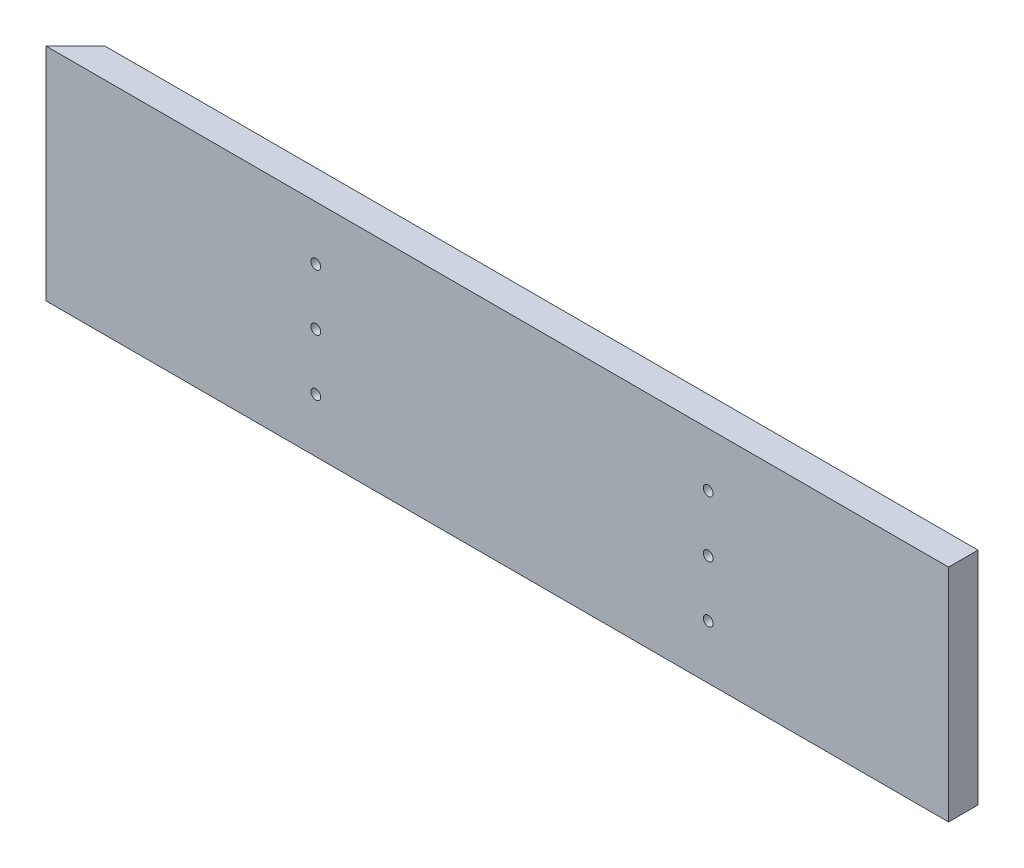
ISO-10303-21;
HEADER;
FILE_DESCRIPTION(('STEP AP214'),'2;1');
FILE_NAME('part.step','',(''),(''),'','','');
FILE_SCHEMA(('AUTOMOTIVE_DESIGN { 1 0 10303 214 1 1 1 1 }'));
ENDSEC;
DATA;
#1=APPLICATION_CONTEXT('core data for automotive mechanical design processes');
#2=APPLICATION_PROTOCOL_DEFINITION('international standard','automotive_design',2000,#1);
#3=PRODUCT_CONTEXT('',#1,'mechanical');
#4=PRODUCT('Part','Part','',(#3));
#5=PRODUCT_RELATED_PRODUCT_CATEGORY('part','',(#4));
#6=PRODUCT_DEFINITION_FORMATION('','',#4);
#7=PRODUCT_DEFINITION_CONTEXT('part definition',#1,'design');
#8=PRODUCT_DEFINITION('design','',#6,#7);
#9=PRODUCT_DEFINITION_SHAPE('','',#8);
#10=(LENGTH_UNIT() NAMED_UNIT(*) SI_UNIT(.MILLI.,.METRE.));
#11=(NAMED_UNIT(*) PLANE_ANGLE_UNIT() SI_UNIT($,.RADIAN.));
#12=(NAMED_UNIT(*) SI_UNIT($,.STERADIAN.) SOLID_ANGLE_UNIT());
#13=UNCERTAINTY_MEASURE_WITH_UNIT(LENGTH_MEASURE(1.E-05),#10,'distance_accuracy_value','');
#14=(GEOMETRIC_REPRESENTATION_CONTEXT(3) GLOBAL_UNCERTAINTY_ASSIGNED_CONTEXT((#13)) GLOBAL_UNIT_ASSIGNED_CONTEXT((#10,
#11,#12)) REPRESENTATION_CONTEXT('',''));
#15=CARTESIAN_POINT('',(0.,0.,0.));
#16=DIRECTION('',(0.,0.,1.));
#17=DIRECTION('',(1.,0.,0.));
#18=AXIS2_PLACEMENT_3D('',#15,#16,#17);
#19=CARTESIAN_POINT('',(1168.4,0.,0.));
#20=DIRECTION('',(0.,0.,-1.));
#21=DIRECTION('',(-1.,0.,0.));
#22=AXIS2_PLACEMENT_3D('',#19,#20,#21);
#23=PLANE('',#22);
#24=CARTESIAN_POINT('',(857.25,215.9,0.));
#25=DIRECTION('',(0.,0.,1.));
#26=DIRECTION('',(1.,0.,0.));
#27=AXIS2_PLACEMENT_3D('',#24,#25,#26);
#28=CIRCLE('',#27,6.34999999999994);
#29=CARTESIAN_POINT('',(863.6,215.9,0.));
#30=VERTEX_POINT('',#29);
#31=EDGE_CURVE('E132',#30,#30,#28,.T.);
#32=ORIENTED_EDGE('',*,*,#31,.F.);
#33=EDGE_LOOP('',(#32));
#34=FACE_BOUND('',#33,.T.);
#35=CARTESIAN_POINT('',(857.25,69.8500000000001,0.));
#36=DIRECTION('',(0.,0.,1.));
#37=DIRECTION('',(1.,0.,0.));
#38=AXIS2_PLACEMENT_3D('',#35,#36,#37);
#39=CIRCLE('',#38,6.34999999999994);
#40=CARTESIAN_POINT('',(863.6,69.8500000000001,0.));
#41=VERTEX_POINT('',#40);
#42=EDGE_CURVE('E121',#41,#41,#39,.T.);
#43=ORIENTED_EDGE('',*,*,#42,.F.);
#44=EDGE_LOOP('',(#43));
#45=FACE_BOUND('',#44,.T.);
#46=CARTESIAN_POINT('',(349.25,69.85,0.));
#47=DIRECTION('',(0.,0.,1.));
#48=DIRECTION('',(1.,0.,0.));
#49=AXIS2_PLACEMENT_3D('',#46,#47,#48);
#50=CIRCLE('',#49,6.34999999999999);
#51=CARTESIAN_POINT('',(355.6,69.85,0.));
#52=VERTEX_POINT('',#51);
#53=EDGE_CURVE('E120',#52,#52,#50,.T.);
#54=ORIENTED_EDGE('',*,*,#53,.F.);
#55=EDGE_LOOP('',(#54));
#56=FACE_BOUND('',#55,.T.);
#57=CARTESIAN_POINT('',(857.25,142.875,0.));
#58=DIRECTION('',(0.,0.,1.));
#59=DIRECTION('',(1.,0.,0.));
#60=AXIS2_PLACEMENT_3D('',#57,#58,#59);
#61=CIRCLE('',#60,6.34999999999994);
#62=CARTESIAN_POINT('',(863.6,142.875,0.));
#63=VERTEX_POINT('',#62);
#64=EDGE_CURVE('E115',#63,#63,#61,.T.);
#65=ORIENTED_EDGE('',*,*,#64,.F.);
#66=EDGE_LOOP('',(#65));
#67=FACE_BOUND('',#66,.T.);
#68=CARTESIAN_POINT('',(349.25,215.9,0.));
#69=DIRECTION('',(0.,0.,1.));
#70=DIRECTION('',(1.,0.,0.));
#71=AXIS2_PLACEMENT_3D('',#68,#69,#70);
#72=CIRCLE('',#71,6.34999999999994);
#73=CARTESIAN_POINT('',(355.6,215.9,0.));
#74=VERTEX_POINT('',#73);
#75=EDGE_CURVE('E133',#74,#74,#72,.T.);
#76=ORIENTED_EDGE('',*,*,#75,.F.);
#77=EDGE_LOOP('',(#76));
#78=FACE_BOUND('',#77,.T.);
#79=CARTESIAN_POINT('',(349.25,142.875,0.));
#80=DIRECTION('',(0.,0.,1.));
#81=DIRECTION('',(1.,0.,0.));
#82=AXIS2_PLACEMENT_3D('',#79,#80,#81);
#83=CIRCLE('',#82,6.34999999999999);
#84=CARTESIAN_POINT('',(355.6,142.875,0.));
#85=VERTEX_POINT('',#84);
#86=EDGE_CURVE('E99',#85,#85,#83,.T.);
#87=ORIENTED_EDGE('',*,*,#86,.F.);
#88=EDGE_LOOP('',(#87));
#89=FACE_BOUND('',#88,.T.);
#90=DIRECTION('',(0.,-1.,0.));
#91=VECTOR('',#90,1.);
#92=CARTESIAN_POINT('',(0.,0.,0.));
#93=LINE('',#92,#91);
#94=CARTESIAN_POINT('',(0.,285.75,0.));
#95=VERTEX_POINT('',#94);
#96=CARTESIAN_POINT('',(0.,0.,0.));
#97=VERTEX_POINT('',#96);
#98=EDGE_CURVE('E80',#95,#97,#93,.T.);
#99=ORIENTED_EDGE('',*,*,#98,.T.);
#100=DIRECTION('',(-1.,0.,0.));
#101=VECTOR('',#100,1.);
#102=CARTESIAN_POINT('',(1168.4,0.,0.));
#103=LINE('',#102,#101);
#104=CARTESIAN_POINT('',(1168.4,0.,0.));
#105=VERTEX_POINT('',#104);
#106=EDGE_CURVE('E11',#105,#97,#103,.T.);
#107=ORIENTED_EDGE('',*,*,#106,.F.);
#108=DIRECTION('',(0.,-1.,0.));
#109=VECTOR('',#108,1.);
#110=CARTESIAN_POINT('',(1168.4,0.,0.));
#111=LINE('',#110,#109);
#112=CARTESIAN_POINT('',(1168.4,285.75,0.));
#113=VERTEX_POINT('',#112);
#114=EDGE_CURVE('E94',#113,#105,#111,.T.);
#115=ORIENTED_EDGE('',*,*,#114,.F.);
#116=DIRECTION('',(-1.,0.,0.));
#117=VECTOR('',#116,1.);
#118=CARTESIAN_POINT('',(1168.4,285.75,0.));
#119=LINE('',#118,#117);
#120=EDGE_CURVE('E93',#113,#95,#119,.T.);
#121=ORIENTED_EDGE('',*,*,#120,.T.);
#122=EDGE_LOOP('',(#99,#107,#115,#121));
#123=FACE_BOUND('',#122,.T.);
#124=ADVANCED_FACE('F39',(#34,#45,#56,#67,#78,#89,#123),#23,.F.);
#125=CARTESIAN_POINT('',(1168.4,0.,0.));
#126=DIRECTION('',(0.,1.,0.));
#127=DIRECTION('',(0.,0.,1.));
#128=AXIS2_PLACEMENT_3D('',#125,#126,#127);
#129=PLANE('',#128);
#130=ORIENTED_EDGE('',*,*,#106,.T.);
#131=DIRECTION('',(0.707106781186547,0.,-0.707106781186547));
#132=VECTOR('',#131,1.);
#133=CARTESIAN_POINT('',(0.,0.,0.));
#134=LINE('',#133,#132);
#135=CARTESIAN_POINT('',(38.1,0.,-38.1));
#136=VERTEX_POINT('',#135);
#137=EDGE_CURVE('E77',#97,#136,#134,.T.);
#138=ORIENTED_EDGE('',*,*,#137,.T.);
#139=DIRECTION('',(-1.,0.,0.));
#140=VECTOR('',#139,1.);
#141=CARTESIAN_POINT('',(1168.4,0.,-38.1));
#142=LINE('',#141,#140);
#143=CARTESIAN_POINT('',(1168.4,0.,-38.1));
#144=VERTEX_POINT('',#143);
#145=EDGE_CURVE('E47',#144,#136,#142,.T.);
#146=ORIENTED_EDGE('',*,*,#145,.F.);
#147=DIRECTION('',(0.,0.,-1.));
#148=VECTOR('',#147,1.);
#149=CARTESIAN_POINT('',(1168.4,0.,0.));
#150=LINE('',#149,#148);
#151=EDGE_CURVE('E89',#105,#144,#150,.T.);
#152=ORIENTED_EDGE('',*,*,#151,.F.);
#153=EDGE_LOOP('',(#130,#138,#146,#152));
#154=FACE_BOUND('',#153,.T.);
#155=ADVANCED_FACE('F88',(#154),#129,.F.);
#156=CARTESIAN_POINT('',(1168.4,0.,-38.1));
#157=DIRECTION('',(0.,0.,1.));
#158=DIRECTION('',(1.,0.,0.));
#159=AXIS2_PLACEMENT_3D('',#156,#157,#158);
#160=PLANE('',#159);
#161=CARTESIAN_POINT('',(857.25,215.9,-38.1));
#162=DIRECTION('',(0.,0.,1.));
#163=DIRECTION('',(1.,0.,0.));
#164=AXIS2_PLACEMENT_3D('',#161,#162,#163);
#165=CIRCLE('',#164,6.34999999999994);
#166=CARTESIAN_POINT('',(863.6,215.9,-38.1));
#167=VERTEX_POINT('',#166);
#168=EDGE_CURVE('E129',#167,#167,#165,.T.);
#169=ORIENTED_EDGE('',*,*,#168,.T.);
#170=EDGE_LOOP('',(#169));
#171=FACE_BOUND('',#170,.T.);
#172=CARTESIAN_POINT('',(857.25,69.8500000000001,-38.1));
#173=DIRECTION('',(0.,0.,1.));
#174=DIRECTION('',(1.,0.,0.));
#175=AXIS2_PLACEMENT_3D('',#172,#173,#174);
#176=CIRCLE('',#175,6.34999999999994);
#177=CARTESIAN_POINT('',(863.6,69.8500000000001,-38.1));
#178=VERTEX_POINT('',#177);
#179=EDGE_CURVE('E136',#178,#178,#176,.T.);
#180=ORIENTED_EDGE('',*,*,#179,.T.);
#181=EDGE_LOOP('',(#180));
#182=FACE_BOUND('',#181,.T.);
#183=CARTESIAN_POINT('',(349.25,69.85,-38.1));
#184=DIRECTION('',(0.,0.,1.));
#185=DIRECTION('',(1.,0.,0.));
#186=AXIS2_PLACEMENT_3D('',#183,#184,#185);
#187=CIRCLE('',#186,6.34999999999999);
#188=CARTESIAN_POINT('',(355.6,69.85,-38.1));
#189=VERTEX_POINT('',#188);
#190=EDGE_CURVE('E117',#189,#189,#187,.T.);
#191=ORIENTED_EDGE('',*,*,#190,.T.);
#192=EDGE_LOOP('',(#191));
#193=FACE_BOUND('',#192,.T.);
#194=CARTESIAN_POINT('',(857.25,142.875,-38.1));
#195=DIRECTION('',(0.,0.,1.));
#196=DIRECTION('',(1.,0.,0.));
#197=AXIS2_PLACEMENT_3D('',#194,#195,#196);
#198=CIRCLE('',#197,6.34999999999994);
#199=CARTESIAN_POINT('',(863.6,142.875,-38.1));
#200=VERTEX_POINT('',#199);
#201=EDGE_CURVE('E124',#200,#200,#198,.T.);
#202=ORIENTED_EDGE('',*,*,#201,.T.);
#203=EDGE_LOOP('',(#202));
#204=FACE_BOUND('',#203,.T.);
#205=CARTESIAN_POINT('',(349.25,215.9,-38.1));
#206=DIRECTION('',(0.,0.,1.));
#207=DIRECTION('',(1.,0.,0.));
#208=AXIS2_PLACEMENT_3D('',#205,#206,#207);
#209=CIRCLE('',#208,6.34999999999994);
#210=CARTESIAN_POINT('',(355.6,215.9,-38.1));
#211=VERTEX_POINT('',#210);
#212=EDGE_CURVE('E141',#211,#211,#209,.T.);
#213=ORIENTED_EDGE('',*,*,#212,.T.);
#214=EDGE_LOOP('',(#213));
#215=FACE_BOUND('',#214,.T.);
#216=CARTESIAN_POINT('',(349.25,142.875,-38.1));
#217=DIRECTION('',(0.,0.,1.));
#218=DIRECTION('',(1.,0.,0.));
#219=AXIS2_PLACEMENT_3D('',#216,#217,#218);
#220=CIRCLE('',#219,6.34999999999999);
#221=CARTESIAN_POINT('',(355.6,142.875,-38.1));
#222=VERTEX_POINT('',#221);
#223=EDGE_CURVE('E95',#222,#222,#220,.T.);
#224=ORIENTED_EDGE('',*,*,#223,.T.);
#225=EDGE_LOOP('',(#224));
#226=FACE_BOUND('',#225,.T.);
#227=ORIENTED_EDGE('',*,*,#145,.T.);
#228=DIRECTION('',(0.,1.,0.));
#229=VECTOR('',#228,1.);
#230=CARTESIAN_POINT('',(38.1,0.,-38.1));
#231=LINE('',#230,#229);
#232=CARTESIAN_POINT('',(38.1,285.75,-38.1));
#233=VERTEX_POINT('',#232);
#234=EDGE_CURVE('E75',#136,#233,#231,.T.);
#235=ORIENTED_EDGE('',*,*,#234,.T.);
#236=DIRECTION('',(-1.,0.,0.));
#237=VECTOR('',#236,1.);
#238=CARTESIAN_POINT('',(1168.4,285.75,-38.1));
#239=LINE('',#238,#237);
#240=CARTESIAN_POINT('',(1168.4,285.75,-38.1));
#241=VERTEX_POINT('',#240);
#242=EDGE_CURVE('E105',#241,#233,#239,.T.);
#243=ORIENTED_EDGE('',*,*,#242,.F.);
#244=DIRECTION('',(0.,1.,0.));
#245=VECTOR('',#244,1.);
#246=CARTESIAN_POINT('',(1168.4,0.,-38.1));
#247=LINE('',#246,#245);
#248=EDGE_CURVE('E111',#144,#241,#247,.T.);
#249=ORIENTED_EDGE('',*,*,#248,.F.);
#250=EDGE_LOOP('',(#227,#235,#243,#249));
#251=FACE_BOUND('',#250,.T.);
#252=ADVANCED_FACE('F109',(#171,#182,#193,#204,#215,#226,#251),#160,.F.);
#253=CARTESIAN_POINT('',(1168.4,285.75,0.));
#254=DIRECTION('',(0.,-1.,0.));
#255=DIRECTION('',(0.,0.,-1.));
#256=AXIS2_PLACEMENT_3D('',#253,#254,#255);
#257=PLANE('',#256);
#258=ORIENTED_EDGE('',*,*,#242,.T.);
#259=DIRECTION('',(0.707106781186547,0.,-0.707106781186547));
#260=VECTOR('',#259,1.);
#261=CARTESIAN_POINT('',(0.,285.75,0.));
#262=LINE('',#261,#260);
#263=EDGE_CURVE('E85',#95,#233,#262,.T.);
#264=ORIENTED_EDGE('',*,*,#263,.F.);
#265=ORIENTED_EDGE('',*,*,#120,.F.);
#266=DIRECTION('',(0.,0.,1.));
#267=VECTOR('',#266,1.);
#268=CARTESIAN_POINT('',(1168.4,285.75,0.));
#269=LINE('',#268,#267);
#270=EDGE_CURVE('E54',#241,#113,#269,.T.);
#271=ORIENTED_EDGE('',*,*,#270,.F.);
#272=EDGE_LOOP('',(#258,#264,#265,#271));
#273=FACE_BOUND('',#272,.T.);
#274=ADVANCED_FACE('F148',(#273),#257,.F.);
#275=CARTESIAN_POINT('',(1168.4,0.,0.));
#276=DIRECTION('',(-1.,0.,0.));
#277=DIRECTION('',(0.,0.,1.));
#278=AXIS2_PLACEMENT_3D('',#275,#276,#277);
#279=PLANE('',#278);
#280=ORIENTED_EDGE('',*,*,#114,.T.);
#281=ORIENTED_EDGE('',*,*,#151,.T.);
#282=ORIENTED_EDGE('',*,*,#248,.T.);
#283=ORIENTED_EDGE('',*,*,#270,.T.);
#284=EDGE_LOOP('',(#280,#281,#282,#283));
#285=FACE_BOUND('',#284,.T.);
#286=ADVANCED_FACE('F149',(#285),#279,.F.);
#287=CARTESIAN_POINT('',(349.25,142.875,-38.1));
#288=DIRECTION('',(0.,0.,1.));
#289=DIRECTION('',(1.,0.,0.));
#290=AXIS2_PLACEMENT_3D('',#287,#288,#289);
#291=CYLINDRICAL_SURFACE('',#290,6.34999999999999);
#292=CARTESIAN_POINT('',(355.6,142.875,-38.1));
#293=CARTESIAN_POINT('',(355.6,142.875,-37.703125));
#294=CARTESIAN_POINT('',(355.6,142.875,-37.30625));
#295=CARTESIAN_POINT('',(355.6,142.875,-36.5125));
#296=CARTESIAN_POINT('',(355.6,142.875,-36.115625));
#297=CARTESIAN_POINT('',(355.6,142.875,-35.321875));
#298=CARTESIAN_POINT('',(355.6,142.875,-34.925));
#299=CARTESIAN_POINT('',(355.6,142.875,-34.13125));
#300=CARTESIAN_POINT('',(355.6,142.875,-33.734375));
#301=CARTESIAN_POINT('',(355.6,142.875,-32.940625));
#302=CARTESIAN_POINT('',(355.6,142.875,-32.54375));
#303=CARTESIAN_POINT('',(355.6,142.875,-31.75));
#304=CARTESIAN_POINT('',(355.6,142.875,-31.353125));
#305=CARTESIAN_POINT('',(355.6,142.875,-30.559375));
#306=CARTESIAN_POINT('',(355.6,142.875,-30.1625));
#307=CARTESIAN_POINT('',(355.6,142.875,-29.36875));
#308=CARTESIAN_POINT('',(355.6,142.875,-28.971875));
#309=CARTESIAN_POINT('',(355.6,142.875,-28.178125));
#310=CARTESIAN_POINT('',(355.6,142.875,-27.78125));
#311=CARTESIAN_POINT('',(355.6,142.875,-26.9875));
#312=CARTESIAN_POINT('',(355.6,142.875,-26.590625));
#313=CARTESIAN_POINT('',(355.6,142.875,-25.796875));
#314=CARTESIAN_POINT('',(355.6,142.875,-25.4));
#315=CARTESIAN_POINT('',(355.6,142.875,-24.60625));
#316=CARTESIAN_POINT('',(355.6,142.875,-24.209375));
#317=CARTESIAN_POINT('',(355.6,142.875,-23.415625));
#318=CARTESIAN_POINT('',(355.6,142.875,-23.01875));
#319=CARTESIAN_POINT('',(355.6,142.875,-22.225));
#320=CARTESIAN_POINT('',(355.6,142.875,-21.828125));
#321=CARTESIAN_POINT('',(355.6,142.875,-21.034375));
#322=CARTESIAN_POINT('',(355.6,142.875,-20.6375));
#323=CARTESIAN_POINT('',(355.6,142.875,-19.84375));
#324=CARTESIAN_POINT('',(355.6,142.875,-19.446875));
#325=CARTESIAN_POINT('',(355.6,142.875,-18.653125));
#326=CARTESIAN_POINT('',(355.6,142.875,-18.25625));
#327=CARTESIAN_POINT('',(355.6,142.875,-17.4625));
#328=CARTESIAN_POINT('',(355.6,142.875,-17.065625));
#329=CARTESIAN_POINT('',(355.6,142.875,-16.271875));
#330=CARTESIAN_POINT('',(355.6,142.875,-15.875));
#331=CARTESIAN_POINT('',(355.6,142.875,-15.08125));
#332=CARTESIAN_POINT('',(355.6,142.875,-14.684375));
#333=CARTESIAN_POINT('',(355.6,142.875,-13.890625));
#334=CARTESIAN_POINT('',(355.6,142.875,-13.49375));
#335=CARTESIAN_POINT('',(355.6,142.875,-12.7));
#336=CARTESIAN_POINT('',(355.6,142.875,-12.303125));
#337=CARTESIAN_POINT('',(355.6,142.875,-11.509375));
#338=CARTESIAN_POINT('',(355.6,142.875,-11.1125));
#339=CARTESIAN_POINT('',(355.6,142.875,-10.31875));
#340=CARTESIAN_POINT('',(355.6,142.875,-9.921875));
#341=CARTESIAN_POINT('',(355.6,142.875,-9.128125));
#342=CARTESIAN_POINT('',(355.6,142.875,-8.73125));
#343=CARTESIAN_POINT('',(355.6,142.875,-7.9375));
#344=CARTESIAN_POINT('',(355.6,142.875,-7.540625));
#345=CARTESIAN_POINT('',(355.6,142.875,-6.746875));
#346=CARTESIAN_POINT('',(355.6,142.875,-6.35));
#347=CARTESIAN_POINT('',(355.6,142.875,-5.55625));
#348=CARTESIAN_POINT('',(355.6,142.875,-5.159375));
#349=CARTESIAN_POINT('',(355.6,142.875,-4.365625));
#350=CARTESIAN_POINT('',(355.6,142.875,-3.96875));
#351=CARTESIAN_POINT('',(355.6,142.875,-3.175));
#352=CARTESIAN_POINT('',(355.6,142.875,-2.778125));
#353=CARTESIAN_POINT('',(355.6,142.875,-1.984375));
#354=CARTESIAN_POINT('',(355.6,142.875,-1.5875));
#355=CARTESIAN_POINT('',(355.6,142.875,-0.79375));
#356=CARTESIAN_POINT('',(355.6,142.875,-0.396875));
#357=CARTESIAN_POINT('',(355.6,142.875,0.));
#358=B_SPLINE_CURVE_WITH_KNOTS('',3,(#292,#293,#294,#295,#296,#297,#298,#299,#300,#301,#302,
#303,#304,#305,#306,#307,#308,#309,#310,#311,#312,#313,#314,#315,#316,#317,#318,#319,#320,#321,
#322,#323,#324,#325,#326,#327,#328,#329,#330,#331,#332,#333,#334,#335,#336,#337,#338,#339,#340,
#341,#342,#343,#344,#345,#346,#347,#348,#349,#350,#351,#352,#353,#354,#355,#356,#357),
.UNSPECIFIED.,.F.,.F.,(4,2,2,2,2,2,2,2,2,2,2,2,2,2,2,2,2,2,2,2,2,2,2,2,2,2,2,2,2,2,2,2,4),(0.,
1.190625,2.38125,3.571875,4.7625,5.953125,7.14375,8.334375,9.52500000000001,10.715625,11.90625,
13.096875,14.2875,15.478125,16.66875,17.859375,19.05,20.240625,21.43125,22.621875,23.8125,
25.003125,26.19375,27.384375,28.575,29.765625,30.95625,32.146875,33.3375,34.528125,35.71875,
36.909375,38.1),.UNSPECIFIED.);
#359=EDGE_CURVE('BSEAM151',#222,#85,#358,.T.);
#360=ORIENTED_EDGE('',*,*,#223,.F.);
#361=ORIENTED_EDGE('',*,*,#86,.T.);
#362=ORIENTED_EDGE('',*,*,#359,.T.);
#363=ORIENTED_EDGE('',*,*,#359,.F.);
#364=EDGE_LOOP('',(#360,#362,#361,#363));
#365=FACE_BOUND('',#364,.T.);
#366=ADVANCED_FACE('F151',(#365),#291,.F.);
#367=CARTESIAN_POINT('',(349.25,215.9,-38.1));
#368=DIRECTION('',(0.,0.,1.));
#369=DIRECTION('',(1.,0.,0.));
#370=AXIS2_PLACEMENT_3D('',#367,#368,#369);
#371=CYLINDRICAL_SURFACE('',#370,6.34999999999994);
#372=CARTESIAN_POINT('',(355.6,215.9,-38.1));
#373=CARTESIAN_POINT('',(355.6,215.9,-37.703125));
#374=CARTESIAN_POINT('',(355.6,215.9,-37.30625));
#375=CARTESIAN_POINT('',(355.6,215.9,-36.5125));
#376=CARTESIAN_POINT('',(355.6,215.9,-36.115625));
#377=CARTESIAN_POINT('',(355.6,215.9,-35.321875));
#378=CARTESIAN_POINT('',(355.6,215.9,-34.925));
#379=CARTESIAN_POINT('',(355.6,215.9,-34.13125));
#380=CARTESIAN_POINT('',(355.6,215.9,-33.734375));
#381=CARTESIAN_POINT('',(355.6,215.9,-32.940625));
#382=CARTESIAN_POINT('',(355.6,215.9,-32.54375));
#383=CARTESIAN_POINT('',(355.6,215.9,-31.75));
#384=CARTESIAN_POINT('',(355.6,215.9,-31.353125));
#385=CARTESIAN_POINT('',(355.6,215.9,-30.559375));
#386=CARTESIAN_POINT('',(355.6,215.9,-30.1625));
#387=CARTESIAN_POINT('',(355.6,215.9,-29.36875));
#388=CARTESIAN_POINT('',(355.6,215.9,-28.971875));
#389=CARTESIAN_POINT('',(355.6,215.9,-28.178125));
#390=CARTESIAN_POINT('',(355.6,215.9,-27.78125));
#391=CARTESIAN_POINT('',(355.6,215.9,-26.9875));
#392=CARTESIAN_POINT('',(355.6,215.9,-26.590625));
#393=CARTESIAN_POINT('',(355.6,215.9,-25.796875));
#394=CARTESIAN_POINT('',(355.6,215.9,-25.4));
#395=CARTESIAN_POINT('',(355.6,215.9,-24.60625));
#396=CARTESIAN_POINT('',(355.6,215.9,-24.209375));
#397=CARTESIAN_POINT('',(355.6,215.9,-23.415625));
#398=CARTESIAN_POINT('',(355.6,215.9,-23.01875));
#399=CARTESIAN_POINT('',(355.6,215.9,-22.225));
#400=CARTESIAN_POINT('',(355.6,215.9,-21.828125));
#401=CARTESIAN_POINT('',(355.6,215.9,-21.034375));
#402=CARTESIAN_POINT('',(355.6,215.9,-20.6375));
#403=CARTESIAN_POINT('',(355.6,215.9,-19.84375));
#404=CARTESIAN_POINT('',(355.6,215.9,-19.446875));
#405=CARTESIAN_POINT('',(355.6,215.9,-18.653125));
#406=CARTESIAN_POINT('',(355.6,215.9,-18.25625));
#407=CARTESIAN_POINT('',(355.6,215.9,-17.4625));
#408=CARTESIAN_POINT('',(355.6,215.9,-17.065625));
#409=CARTESIAN_POINT('',(355.6,215.9,-16.271875));
#410=CARTESIAN_POINT('',(355.6,215.9,-15.875));
#411=CARTESIAN_POINT('',(355.6,215.9,-15.08125));
#412=CARTESIAN_POINT('',(355.6,215.9,-14.684375));
#413=CARTESIAN_POINT('',(355.6,215.9,-13.890625));
#414=CARTESIAN_POINT('',(355.6,215.9,-13.49375));
#415=CARTESIAN_POINT('',(355.6,215.9,-12.7));
#416=CARTESIAN_POINT('',(355.6,215.9,-12.303125));
#417=CARTESIAN_POINT('',(355.6,215.9,-11.509375));
#418=CARTESIAN_POINT('',(355.6,215.9,-11.1125));
#419=CARTESIAN_POINT('',(355.6,215.9,-10.31875));
#420=CARTESIAN_POINT('',(355.6,215.9,-9.921875));
#421=CARTESIAN_POINT('',(355.6,215.9,-9.128125));
#422=CARTESIAN_POINT('',(355.6,215.9,-8.73125));
#423=CARTESIAN_POINT('',(355.6,215.9,-7.9375));
#424=CARTESIAN_POINT('',(355.6,215.9,-7.540625));
#425=CARTESIAN_POINT('',(355.6,215.9,-6.746875));
#426=CARTESIAN_POINT('',(355.6,215.9,-6.35));
#427=CARTESIAN_POINT('',(355.6,215.9,-5.55625));
#428=CARTESIAN_POINT('',(355.6,215.9,-5.159375));
#429=CARTESIAN_POINT('',(355.6,215.9,-4.365625));
#430=CARTESIAN_POINT('',(355.6,215.9,-3.96875));
#431=CARTESIAN_POINT('',(355.6,215.9,-3.175));
#432=CARTESIAN_POINT('',(355.6,215.9,-2.778125));
#433=CARTESIAN_POINT('',(355.6,215.9,-1.984375));
#434=CARTESIAN_POINT('',(355.6,215.9,-1.5875));
#435=CARTESIAN_POINT('',(355.6,215.9,-0.79375));
#436=CARTESIAN_POINT('',(355.6,215.9,-0.396875));
#437=CARTESIAN_POINT('',(355.6,215.9,0.));
#438=B_SPLINE_CURVE_WITH_KNOTS('',3,(#372,#373,#374,#375,#376,#377,#378,#379,#380,#381,#382,
#383,#384,#385,#386,#387,#388,#389,#390,#391,#392,#393,#394,#395,#396,#397,#398,#399,#400,#401,
#402,#403,#404,#405,#406,#407,#408,#409,#410,#411,#412,#413,#414,#415,#416,#417,#418,#419,#420,
#421,#422,#423,#424,#425,#426,#427,#428,#429,#430,#431,#432,#433,#434,#435,#436,#437),
.UNSPECIFIED.,.F.,.F.,(4,2,2,2,2,2,2,2,2,2,2,2,2,2,2,2,2,2,2,2,2,2,2,2,2,2,2,2,2,2,2,2,4),(0.,
1.190625,2.38125,3.571875,4.7625,5.953125,7.14375,8.334375,9.52500000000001,10.715625,11.90625,
13.096875,14.2875,15.478125,16.66875,17.859375,19.05,20.240625,21.43125,22.621875,23.8125,
25.003125,26.19375,27.384375,28.575,29.765625,30.95625,32.146875,33.3375,34.528125,35.71875,
36.909375,38.1),.UNSPECIFIED.);
#439=EDGE_CURVE('BSEAM156',#211,#74,#438,.T.);
#440=ORIENTED_EDGE('',*,*,#212,.F.);
#441=ORIENTED_EDGE('',*,*,#75,.T.);
#442=ORIENTED_EDGE('',*,*,#439,.T.);
#443=ORIENTED_EDGE('',*,*,#439,.F.);
#444=EDGE_LOOP('',(#440,#442,#441,#443));
#445=FACE_BOUND('',#444,.T.);
#446=ADVANCED_FACE('F156',(#445),#371,.F.);
#447=CARTESIAN_POINT('',(857.25,142.875,-38.1));
#448=DIRECTION('',(0.,0.,1.));
#449=DIRECTION('',(1.,0.,0.));
#450=AXIS2_PLACEMENT_3D('',#447,#448,#449);
#451=CYLINDRICAL_SURFACE('',#450,6.34999999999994);
#452=CARTESIAN_POINT('',(863.6,142.875,-38.1));
#453=CARTESIAN_POINT('',(863.6,142.875,-37.703125));
#454=CARTESIAN_POINT('',(863.6,142.875,-37.30625));
#455=CARTESIAN_POINT('',(863.6,142.875,-36.5125));
#456=CARTESIAN_POINT('',(863.6,142.875,-36.115625));
#457=CARTESIAN_POINT('',(863.6,142.875,-35.321875));
#458=CARTESIAN_POINT('',(863.6,142.875,-34.925));
#459=CARTESIAN_POINT('',(863.6,142.875,-34.13125));
#460=CARTESIAN_POINT('',(863.6,142.875,-33.734375));
#461=CARTESIAN_POINT('',(863.6,142.875,-32.940625));
#462=CARTESIAN_POINT('',(863.6,142.875,-32.54375));
#463=CARTESIAN_POINT('',(863.6,142.875,-31.75));
#464=CARTESIAN_POINT('',(863.6,142.875,-31.353125));
#465=CARTESIAN_POINT('',(863.6,142.875,-30.559375));
#466=CARTESIAN_POINT('',(863.6,142.875,-30.1625));
#467=CARTESIAN_POINT('',(863.6,142.875,-29.36875));
#468=CARTESIAN_POINT('',(863.6,142.875,-28.971875));
#469=CARTESIAN_POINT('',(863.6,142.875,-28.178125));
#470=CARTESIAN_POINT('',(863.6,142.875,-27.78125));
#471=CARTESIAN_POINT('',(863.6,142.875,-26.9875));
#472=CARTESIAN_POINT('',(863.6,142.875,-26.590625));
#473=CARTESIAN_POINT('',(863.6,142.875,-25.796875));
#474=CARTESIAN_POINT('',(863.6,142.875,-25.4));
#475=CARTESIAN_POINT('',(863.6,142.875,-24.60625));
#476=CARTESIAN_POINT('',(863.6,142.875,-24.209375));
#477=CARTESIAN_POINT('',(863.6,142.875,-23.415625));
#478=CARTESIAN_POINT('',(863.6,142.875,-23.01875));
#479=CARTESIAN_POINT('',(863.6,142.875,-22.225));
#480=CARTESIAN_POINT('',(863.6,142.875,-21.828125));
#481=CARTESIAN_POINT('',(863.6,142.875,-21.034375));
#482=CARTESIAN_POINT('',(863.6,142.875,-20.6375));
#483=CARTESIAN_POINT('',(863.6,142.875,-19.84375));
#484=CARTESIAN_POINT('',(863.6,142.875,-19.446875));
#485=CARTESIAN_POINT('',(863.6,142.875,-18.653125));
#486=CARTESIAN_POINT('',(863.6,142.875,-18.25625));
#487=CARTESIAN_POINT('',(863.6,142.875,-17.4625));
#488=CARTESIAN_POINT('',(863.6,142.875,-17.065625));
#489=CARTESIAN_POINT('',(863.6,142.875,-16.271875));
#490=CARTESIAN_POINT('',(863.6,142.875,-15.875));
#491=CARTESIAN_POINT('',(863.6,142.875,-15.08125));
#492=CARTESIAN_POINT('',(863.6,142.875,-14.684375));
#493=CARTESIAN_POINT('',(863.6,142.875,-13.890625));
#494=CARTESIAN_POINT('',(863.6,142.875,-13.49375));
#495=CARTESIAN_POINT('',(863.6,142.875,-12.7));
#496=CARTESIAN_POINT('',(863.6,142.875,-12.303125));
#497=CARTESIAN_POINT('',(863.6,142.875,-11.509375));
#498=CARTESIAN_POINT('',(863.6,142.875,-11.1125));
#499=CARTESIAN_POINT('',(863.6,142.875,-10.31875));
#500=CARTESIAN_POINT('',(863.6,142.875,-9.921875));
#501=CARTESIAN_POINT('',(863.6,142.875,-9.128125));
#502=CARTESIAN_POINT('',(863.6,142.875,-8.73125));
#503=CARTESIAN_POINT('',(863.6,142.875,-7.9375));
#504=CARTESIAN_POINT('',(863.6,142.875,-7.540625));
#505=CARTESIAN_POINT('',(863.6,142.875,-6.746875));
#506=CARTESIAN_POINT('',(863.6,142.875,-6.35));
#507=CARTESIAN_POINT('',(863.6,142.875,-5.55625));
#508=CARTESIAN_POINT('',(863.6,142.875,-5.159375));
#509=CARTESIAN_POINT('',(863.6,142.875,-4.365625));
#510=CARTESIAN_POINT('',(863.6,142.875,-3.96875));
#511=CARTESIAN_POINT('',(863.6,142.875,-3.175));
#512=CARTESIAN_POINT('',(863.6,142.875,-2.778125));
#513=CARTESIAN_POINT('',(863.6,142.875,-1.984375));
#514=CARTESIAN_POINT('',(863.6,142.875,-1.5875));
#515=CARTESIAN_POINT('',(863.6,142.875,-0.79375));
#516=CARTESIAN_POINT('',(863.6,142.875,-0.396875));
#517=CARTESIAN_POINT('',(863.6,142.875,0.));
#518=B_SPLINE_CURVE_WITH_KNOTS('',3,(#452,#453,#454,#455,#456,#457,#458,#459,#460,#461,#462,
#463,#464,#465,#466,#467,#468,#469,#470,#471,#472,#473,#474,#475,#476,#477,#478,#479,#480,#481,
#482,#483,#484,#485,#486,#487,#488,#489,#490,#491,#492,#493,#494,#495,#496,#497,#498,#499,#500,
#501,#502,#503,#504,#505,#506,#507,#508,#509,#510,#511,#512,#513,#514,#515,#516,#517),
.UNSPECIFIED.,.F.,.F.,(4,2,2,2,2,2,2,2,2,2,2,2,2,2,2,2,2,2,2,2,2,2,2,2,2,2,2,2,2,2,2,2,4),(0.,
1.190625,2.38125,3.571875,4.7625,5.953125,7.14375,8.334375,9.52500000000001,10.715625,11.90625,
13.096875,14.2875,15.478125,16.66875,17.859375,19.05,20.240625,21.43125,22.621875,23.8125,
25.003125,26.19375,27.384375,28.575,29.765625,30.95625,32.146875,33.3375,34.528125,35.71875,
36.909375,38.1),.UNSPECIFIED.);
#519=EDGE_CURVE('BSEAM181',#200,#63,#518,.T.);
#520=ORIENTED_EDGE('',*,*,#201,.F.);
#521=ORIENTED_EDGE('',*,*,#64,.T.);
#522=ORIENTED_EDGE('',*,*,#519,.T.);
#523=ORIENTED_EDGE('',*,*,#519,.F.);
#524=EDGE_LOOP('',(#520,#522,#521,#523));
#525=FACE_BOUND('',#524,.T.);
#526=ADVANCED_FACE('F181',(#525),#451,.F.);
#527=CARTESIAN_POINT('',(349.25,69.85,-38.1));
#528=DIRECTION('',(0.,0.,1.));
#529=DIRECTION('',(1.,0.,0.));
#530=AXIS2_PLACEMENT_3D('',#527,#528,#529);
#531=CYLINDRICAL_SURFACE('',#530,6.34999999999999);
#532=CARTESIAN_POINT('',(355.6,69.85,-38.1));
#533=CARTESIAN_POINT('',(355.6,69.85,-37.703125));
#534=CARTESIAN_POINT('',(355.6,69.85,-37.30625));
#535=CARTESIAN_POINT('',(355.6,69.85,-36.5125));
#536=CARTESIAN_POINT('',(355.6,69.85,-36.115625));
#537=CARTESIAN_POINT('',(355.6,69.85,-35.321875));
#538=CARTESIAN_POINT('',(355.6,69.85,-34.925));
#539=CARTESIAN_POINT('',(355.6,69.85,-34.13125));
#540=CARTESIAN_POINT('',(355.6,69.85,-33.734375));
#541=CARTESIAN_POINT('',(355.6,69.85,-32.940625));
#542=CARTESIAN_POINT('',(355.6,69.85,-32.54375));
#543=CARTESIAN_POINT('',(355.6,69.85,-31.75));
#544=CARTESIAN_POINT('',(355.6,69.85,-31.353125));
#545=CARTESIAN_POINT('',(355.6,69.85,-30.559375));
#546=CARTESIAN_POINT('',(355.6,69.85,-30.1625));
#547=CARTESIAN_POINT('',(355.6,69.85,-29.36875));
#548=CARTESIAN_POINT('',(355.6,69.85,-28.971875));
#549=CARTESIAN_POINT('',(355.6,69.85,-28.178125));
#550=CARTESIAN_POINT('',(355.6,69.85,-27.78125));
#551=CARTESIAN_POINT('',(355.6,69.85,-26.9875));
#552=CARTESIAN_POINT('',(355.6,69.85,-26.590625));
#553=CARTESIAN_POINT('',(355.6,69.85,-25.796875));
#554=CARTESIAN_POINT('',(355.6,69.85,-25.4));
#555=CARTESIAN_POINT('',(355.6,69.85,-24.60625));
#556=CARTESIAN_POINT('',(355.6,69.85,-24.209375));
#557=CARTESIAN_POINT('',(355.6,69.85,-23.415625));
#558=CARTESIAN_POINT('',(355.6,69.85,-23.01875));
#559=CARTESIAN_POINT('',(355.6,69.85,-22.225));
#560=CARTESIAN_POINT('',(355.6,69.85,-21.828125));
#561=CARTESIAN_POINT('',(355.6,69.85,-21.034375));
#562=CARTESIAN_POINT('',(355.6,69.85,-20.6375));
#563=CARTESIAN_POINT('',(355.6,69.85,-19.84375));
#564=CARTESIAN_POINT('',(355.6,69.85,-19.446875));
#565=CARTESIAN_POINT('',(355.6,69.85,-18.653125));
#566=CARTESIAN_POINT('',(355.6,69.85,-18.25625));
#567=CARTESIAN_POINT('',(355.6,69.85,-17.4625));
#568=CARTESIAN_POINT('',(355.6,69.85,-17.065625));
#569=CARTESIAN_POINT('',(355.6,69.85,-16.271875));
#570=CARTESIAN_POINT('',(355.6,69.85,-15.875));
#571=CARTESIAN_POINT('',(355.6,69.85,-15.08125));
#572=CARTESIAN_POINT('',(355.6,69.85,-14.684375));
#573=CARTESIAN_POINT('',(355.6,69.85,-13.890625));
#574=CARTESIAN_POINT('',(355.6,69.85,-13.49375));
#575=CARTESIAN_POINT('',(355.6,69.85,-12.7));
#576=CARTESIAN_POINT('',(355.6,69.85,-12.303125));
#577=CARTESIAN_POINT('',(355.6,69.85,-11.509375));
#578=CARTESIAN_POINT('',(355.6,69.85,-11.1125));
#579=CARTESIAN_POINT('',(355.6,69.85,-10.31875));
#580=CARTESIAN_POINT('',(355.6,69.85,-9.921875));
#581=CARTESIAN_POINT('',(355.6,69.85,-9.128125));
#582=CARTESIAN_POINT('',(355.6,69.85,-8.73125));
#583=CARTESIAN_POINT('',(355.6,69.85,-7.9375));
#584=CARTESIAN_POINT('',(355.6,69.85,-7.540625));
#585=CARTESIAN_POINT('',(355.6,69.85,-6.746875));
#586=CARTESIAN_POINT('',(355.6,69.85,-6.35));
#587=CARTESIAN_POINT('',(355.6,69.85,-5.55625));
#588=CARTESIAN_POINT('',(355.6,69.85,-5.159375));
#589=CARTESIAN_POINT('',(355.6,69.85,-4.365625));
#590=CARTESIAN_POINT('',(355.6,69.85,-3.96875));
#591=CARTESIAN_POINT('',(355.6,69.85,-3.175));
#592=CARTESIAN_POINT('',(355.6,69.85,-2.778125));
#593=CARTESIAN_POINT('',(355.6,69.85,-1.984375));
#594=CARTESIAN_POINT('',(355.6,69.85,-1.5875));
#595=CARTESIAN_POINT('',(355.6,69.85,-0.79375));
#596=CARTESIAN_POINT('',(355.6,69.85,-0.396875));
#597=CARTESIAN_POINT('',(355.6,69.85,0.));
#598=B_SPLINE_CURVE_WITH_KNOTS('',3,(#532,#533,#534,#535,#536,#537,#538,#539,#540,#541,#542,
#543,#544,#545,#546,#547,#548,#549,#550,#551,#552,#553,#554,#555,#556,#557,#558,#559,#560,#561,
#562,#563,#564,#565,#566,#567,#568,#569,#570,#571,#572,#573,#574,#575,#576,#577,#578,#579,#580,
#581,#582,#583,#584,#585,#586,#587,#588,#589,#590,#591,#592,#593,#594,#595,#596,#597),
.UNSPECIFIED.,.F.,.F.,(4,2,2,2,2,2,2,2,2,2,2,2,2,2,2,2,2,2,2,2,2,2,2,2,2,2,2,2,2,2,2,2,4),(0.,
1.190625,2.38125,3.571875,4.7625,5.953125,7.14375,8.334375,9.52500000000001,10.715625,11.90625,
13.096875,14.2875,15.478125,16.66875,17.859375,19.05,20.240625,21.43125,22.621875,23.8125,
25.003125,26.19375,27.384375,28.575,29.765625,30.95625,32.146875,33.3375,34.528125,35.71875,
36.909375,38.1),.UNSPECIFIED.);
#599=EDGE_CURVE('BSEAM187',#189,#52,#598,.T.);
#600=ORIENTED_EDGE('',*,*,#190,.F.);
#601=ORIENTED_EDGE('',*,*,#53,.T.);
#602=ORIENTED_EDGE('',*,*,#599,.T.);
#603=ORIENTED_EDGE('',*,*,#599,.F.);
#604=EDGE_LOOP('',(#600,#602,#601,#603));
#605=FACE_BOUND('',#604,.T.);
#606=ADVANCED_FACE('F187',(#605),#531,.F.);
#607=CARTESIAN_POINT('',(857.25,69.8500000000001,-38.1));
#608=DIRECTION('',(0.,0.,1.));
#609=DIRECTION('',(1.,0.,0.));
#610=AXIS2_PLACEMENT_3D('',#607,#608,#609);
#611=CYLINDRICAL_SURFACE('',#610,6.34999999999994);
#612=CARTESIAN_POINT('',(863.6,69.8500000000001,-38.1));
#613=CARTESIAN_POINT('',(863.6,69.8500000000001,-37.703125));
#614=CARTESIAN_POINT('',(863.6,69.8500000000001,-37.30625));
#615=CARTESIAN_POINT('',(863.6,69.8500000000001,-36.5125));
#616=CARTESIAN_POINT('',(863.6,69.8500000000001,-36.115625));
#617=CARTESIAN_POINT('',(863.6,69.8500000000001,-35.321875));
#618=CARTESIAN_POINT('',(863.6,69.8500000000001,-34.925));
#619=CARTESIAN_POINT('',(863.6,69.8500000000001,-34.13125));
#620=CARTESIAN_POINT('',(863.6,69.8500000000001,-33.734375));
#621=CARTESIAN_POINT('',(863.6,69.8500000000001,-32.940625));
#622=CARTESIAN_POINT('',(863.6,69.8500000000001,-32.54375));
#623=CARTESIAN_POINT('',(863.6,69.8500000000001,-31.75));
#624=CARTESIAN_POINT('',(863.6,69.8500000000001,-31.353125));
#625=CARTESIAN_POINT('',(863.6,69.8500000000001,-30.559375));
#626=CARTESIAN_POINT('',(863.6,69.8500000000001,-30.1625));
#627=CARTESIAN_POINT('',(863.6,69.8500000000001,-29.36875));
#628=CARTESIAN_POINT('',(863.6,69.8500000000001,-28.971875));
#629=CARTESIAN_POINT('',(863.6,69.8500000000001,-28.178125));
#630=CARTESIAN_POINT('',(863.6,69.8500000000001,-27.78125));
#631=CARTESIAN_POINT('',(863.6,69.8500000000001,-26.9875));
#632=CARTESIAN_POINT('',(863.6,69.8500000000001,-26.590625));
#633=CARTESIAN_POINT('',(863.6,69.8500000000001,-25.796875));
#634=CARTESIAN_POINT('',(863.6,69.8500000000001,-25.4));
#635=CARTESIAN_POINT('',(863.6,69.8500000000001,-24.60625));
#636=CARTESIAN_POINT('',(863.6,69.8500000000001,-24.209375));
#637=CARTESIAN_POINT('',(863.6,69.8500000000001,-23.415625));
#638=CARTESIAN_POINT('',(863.6,69.8500000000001,-23.01875));
#639=CARTESIAN_POINT('',(863.6,69.8500000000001,-22.225));
#640=CARTESIAN_POINT('',(863.6,69.8500000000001,-21.828125));
#641=CARTESIAN_POINT('',(863.6,69.8500000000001,-21.034375));
#642=CARTESIAN_POINT('',(863.6,69.8500000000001,-20.6375));
#643=CARTESIAN_POINT('',(863.6,69.8500000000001,-19.84375));
#644=CARTESIAN_POINT('',(863.6,69.8500000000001,-19.446875));
#645=CARTESIAN_POINT('',(863.6,69.8500000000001,-18.653125));
#646=CARTESIAN_POINT('',(863.6,69.8500000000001,-18.25625));
#647=CARTESIAN_POINT('',(863.6,69.8500000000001,-17.4625));
#648=CARTESIAN_POINT('',(863.6,69.8500000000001,-17.065625));
#649=CARTESIAN_POINT('',(863.6,69.8500000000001,-16.271875));
#650=CARTESIAN_POINT('',(863.6,69.8500000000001,-15.875));
#651=CARTESIAN_POINT('',(863.6,69.8500000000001,-15.08125));
#652=CARTESIAN_POINT('',(863.6,69.8500000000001,-14.684375));
#653=CARTESIAN_POINT('',(863.6,69.8500000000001,-13.890625));
#654=CARTESIAN_POINT('',(863.6,69.8500000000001,-13.49375));
#655=CARTESIAN_POINT('',(863.6,69.8500000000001,-12.7));
#656=CARTESIAN_POINT('',(863.6,69.8500000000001,-12.303125));
#657=CARTESIAN_POINT('',(863.6,69.8500000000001,-11.509375));
#658=CARTESIAN_POINT('',(863.6,69.8500000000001,-11.1125));
#659=CARTESIAN_POINT('',(863.6,69.8500000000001,-10.31875));
#660=CARTESIAN_POINT('',(863.6,69.8500000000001,-9.921875));
#661=CARTESIAN_POINT('',(863.6,69.8500000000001,-9.128125));
#662=CARTESIAN_POINT('',(863.6,69.8500000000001,-8.73125));
#663=CARTESIAN_POINT('',(863.6,69.8500000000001,-7.9375));
#664=CARTESIAN_POINT('',(863.6,69.8500000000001,-7.540625));
#665=CARTESIAN_POINT('',(863.6,69.8500000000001,-6.746875));
#666=CARTESIAN_POINT('',(863.6,69.8500000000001,-6.35));
#667=CARTESIAN_POINT('',(863.6,69.8500000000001,-5.55625));
#668=CARTESIAN_POINT('',(863.6,69.8500000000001,-5.159375));
#669=CARTESIAN_POINT('',(863.6,69.8500000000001,-4.365625));
#670=CARTESIAN_POINT('',(863.6,69.8500000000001,-3.96875));
#671=CARTESIAN_POINT('',(863.6,69.8500000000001,-3.175));
#672=CARTESIAN_POINT('',(863.6,69.8500000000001,-2.778125));
#673=CARTESIAN_POINT('',(863.6,69.8500000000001,-1.984375));
#674=CARTESIAN_POINT('',(863.6,69.8500000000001,-1.5875));
#675=CARTESIAN_POINT('',(863.6,69.8500000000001,-0.79375));
#676=CARTESIAN_POINT('',(863.6,69.8500000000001,-0.396875));
#677=CARTESIAN_POINT('',(863.6,69.8500000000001,0.));
#678=B_SPLINE_CURVE_WITH_KNOTS('',3,(#612,#613,#614,#615,#616,#617,#618,#619,#620,#621,#622,
#623,#624,#625,#626,#627,#628,#629,#630,#631,#632,#633,#634,#635,#636,#637,#638,#639,#640,#641,
#642,#643,#644,#645,#646,#647,#648,#649,#650,#651,#652,#653,#654,#655,#656,#657,#658,#659,#660,
#661,#662,#663,#664,#665,#666,#667,#668,#669,#670,#671,#672,#673,#674,#675,#676,#677),
.UNSPECIFIED.,.F.,.F.,(4,2,2,2,2,2,2,2,2,2,2,2,2,2,2,2,2,2,2,2,2,2,2,2,2,2,2,2,2,2,2,2,4),(0.,
1.190625,2.38125,3.571875,4.7625,5.953125,7.14375,8.334375,9.52500000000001,10.715625,11.90625,
13.096875,14.2875,15.478125,16.66875,17.859375,19.05,20.240625,21.43125,22.621875,23.8125,
25.003125,26.19375,27.384375,28.575,29.765625,30.95625,32.146875,33.3375,34.528125,35.71875,
36.909375,38.1),.UNSPECIFIED.);
#679=EDGE_CURVE('BSEAM193',#178,#41,#678,.T.);
#680=ORIENTED_EDGE('',*,*,#179,.F.);
#681=ORIENTED_EDGE('',*,*,#42,.T.);
#682=ORIENTED_EDGE('',*,*,#679,.T.);
#683=ORIENTED_EDGE('',*,*,#679,.F.);
#684=EDGE_LOOP('',(#680,#682,#681,#683));
#685=FACE_BOUND('',#684,.T.);
#686=ADVANCED_FACE('F193',(#685),#611,.F.);
#687=CARTESIAN_POINT('',(857.25,215.9,-38.1));
#688=DIRECTION('',(0.,0.,1.));
#689=DIRECTION('',(1.,0.,0.));
#690=AXIS2_PLACEMENT_3D('',#687,#688,#689);
#691=CYLINDRICAL_SURFACE('',#690,6.34999999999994);
#692=CARTESIAN_POINT('',(863.6,215.9,-38.1));
#693=CARTESIAN_POINT('',(863.6,215.9,-37.703125));
#694=CARTESIAN_POINT('',(863.6,215.9,-37.30625));
#695=CARTESIAN_POINT('',(863.6,215.9,-36.5125));
#696=CARTESIAN_POINT('',(863.6,215.9,-36.115625));
#697=CARTESIAN_POINT('',(863.6,215.9,-35.321875));
#698=CARTESIAN_POINT('',(863.6,215.9,-34.925));
#699=CARTESIAN_POINT('',(863.6,215.9,-34.13125));
#700=CARTESIAN_POINT('',(863.6,215.9,-33.734375));
#701=CARTESIAN_POINT('',(863.6,215.9,-32.940625));
#702=CARTESIAN_POINT('',(863.6,215.9,-32.54375));
#703=CARTESIAN_POINT('',(863.6,215.9,-31.75));
#704=CARTESIAN_POINT('',(863.6,215.9,-31.353125));
#705=CARTESIAN_POINT('',(863.6,215.9,-30.559375));
#706=CARTESIAN_POINT('',(863.6,215.9,-30.1625));
#707=CARTESIAN_POINT('',(863.6,215.9,-29.36875));
#708=CARTESIAN_POINT('',(863.6,215.9,-28.971875));
#709=CARTESIAN_POINT('',(863.6,215.9,-28.178125));
#710=CARTESIAN_POINT('',(863.6,215.9,-27.78125));
#711=CARTESIAN_POINT('',(863.6,215.9,-26.9875));
#712=CARTESIAN_POINT('',(863.6,215.9,-26.590625));
#713=CARTESIAN_POINT('',(863.6,215.9,-25.796875));
#714=CARTESIAN_POINT('',(863.6,215.9,-25.4));
#715=CARTESIAN_POINT('',(863.6,215.9,-24.60625));
#716=CARTESIAN_POINT('',(863.6,215.9,-24.209375));
#717=CARTESIAN_POINT('',(863.6,215.9,-23.415625));
#718=CARTESIAN_POINT('',(863.6,215.9,-23.01875));
#719=CARTESIAN_POINT('',(863.6,215.9,-22.225));
#720=CARTESIAN_POINT('',(863.6,215.9,-21.828125));
#721=CARTESIAN_POINT('',(863.6,215.9,-21.034375));
#722=CARTESIAN_POINT('',(863.6,215.9,-20.6375));
#723=CARTESIAN_POINT('',(863.6,215.9,-19.84375));
#724=CARTESIAN_POINT('',(863.6,215.9,-19.446875));
#725=CARTESIAN_POINT('',(863.6,215.9,-18.653125));
#726=CARTESIAN_POINT('',(863.6,215.9,-18.25625));
#727=CARTESIAN_POINT('',(863.6,215.9,-17.4625));
#728=CARTESIAN_POINT('',(863.6,215.9,-17.065625));
#729=CARTESIAN_POINT('',(863.6,215.9,-16.271875));
#730=CARTESIAN_POINT('',(863.6,215.9,-15.875));
#731=CARTESIAN_POINT('',(863.6,215.9,-15.08125));
#732=CARTESIAN_POINT('',(863.6,215.9,-14.684375));
#733=CARTESIAN_POINT('',(863.6,215.9,-13.890625));
#734=CARTESIAN_POINT('',(863.6,215.9,-13.49375));
#735=CARTESIAN_POINT('',(863.6,215.9,-12.7));
#736=CARTESIAN_POINT('',(863.6,215.9,-12.303125));
#737=CARTESIAN_POINT('',(863.6,215.9,-11.509375));
#738=CARTESIAN_POINT('',(863.6,215.9,-11.1125));
#739=CARTESIAN_POINT('',(863.6,215.9,-10.31875));
#740=CARTESIAN_POINT('',(863.6,215.9,-9.921875));
#741=CARTESIAN_POINT('',(863.6,215.9,-9.128125));
#742=CARTESIAN_POINT('',(863.6,215.9,-8.73125));
#743=CARTESIAN_POINT('',(863.6,215.9,-7.9375));
#744=CARTESIAN_POINT('',(863.6,215.9,-7.540625));
#745=CARTESIAN_POINT('',(863.6,215.9,-6.746875));
#746=CARTESIAN_POINT('',(863.6,215.9,-6.35));
#747=CARTESIAN_POINT('',(863.6,215.9,-5.55625));
#748=CARTESIAN_POINT('',(863.6,215.9,-5.159375));
#749=CARTESIAN_POINT('',(863.6,215.9,-4.365625));
#750=CARTESIAN_POINT('',(863.6,215.9,-3.96875));
#751=CARTESIAN_POINT('',(863.6,215.9,-3.175));
#752=CARTESIAN_POINT('',(863.6,215.9,-2.778125));
#753=CARTESIAN_POINT('',(863.6,215.9,-1.984375));
#754=CARTESIAN_POINT('',(863.6,215.9,-1.5875));
#755=CARTESIAN_POINT('',(863.6,215.9,-0.79375));
#756=CARTESIAN_POINT('',(863.6,215.9,-0.396875));
#757=CARTESIAN_POINT('',(863.6,215.9,0.));
#758=B_SPLINE_CURVE_WITH_KNOTS('',3,(#692,#693,#694,#695,#696,#697,#698,#699,#700,#701,#702,
#703,#704,#705,#706,#707,#708,#709,#710,#711,#712,#713,#714,#715,#716,#717,#718,#719,#720,#721,
#722,#723,#724,#725,#726,#727,#728,#729,#730,#731,#732,#733,#734,#735,#736,#737,#738,#739,#740,
#741,#742,#743,#744,#745,#746,#747,#748,#749,#750,#751,#752,#753,#754,#755,#756,#757),
.UNSPECIFIED.,.F.,.F.,(4,2,2,2,2,2,2,2,2,2,2,2,2,2,2,2,2,2,2,2,2,2,2,2,2,2,2,2,2,2,2,2,4),(0.,
1.190625,2.38125,3.571875,4.7625,5.953125,7.14375,8.334375,9.52500000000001,10.715625,11.90625,
13.096875,14.2875,15.478125,16.66875,17.859375,19.05,20.240625,21.43125,22.621875,23.8125,
25.003125,26.19375,27.384375,28.575,29.765625,30.95625,32.146875,33.3375,34.528125,35.71875,
36.909375,38.1),.UNSPECIFIED.);
#759=EDGE_CURVE('BSEAM196',#167,#30,#758,.T.);
#760=ORIENTED_EDGE('',*,*,#168,.F.);
#761=ORIENTED_EDGE('',*,*,#31,.T.);
#762=ORIENTED_EDGE('',*,*,#759,.T.);
#763=ORIENTED_EDGE('',*,*,#759,.F.);
#764=EDGE_LOOP('',(#760,#762,#761,#763));
#765=FACE_BOUND('',#764,.T.);
#766=ADVANCED_FACE('F196',(#765),#691,.F.);
#767=CARTESIAN_POINT('',(0.,0.,0.));
#768=DIRECTION('',(0.707106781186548,0.,0.707106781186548));
#769=DIRECTION('',(0.707106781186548,0.,-0.707106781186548));
#770=AXIS2_PLACEMENT_3D('',#767,#768,#769);
#771=PLANE('',#770);
#772=ORIENTED_EDGE('',*,*,#263,.T.);
#773=ORIENTED_EDGE('',*,*,#234,.F.);
#774=ORIENTED_EDGE('',*,*,#137,.F.);
#775=ORIENTED_EDGE('',*,*,#98,.F.);
#776=EDGE_LOOP('',(#772,#773,#774,#775));
#777=FACE_BOUND('',#776,.T.);
#778=ADVANCED_FACE('F78',(#777),#771,.F.);
#779=CLOSED_SHELL('',(#124,#155,#252,#274,#286,#366,#446,#526,#606,#686,#766,#778));
#780=MANIFOLD_SOLID_BREP('B2',#779);
#781=ADVANCED_BREP_SHAPE_REPRESENTATION('',(#18,#780),#14);
#782=SHAPE_DEFINITION_REPRESENTATION(#9,#781);
ENDSEC;
END-ISO-10303-21;
